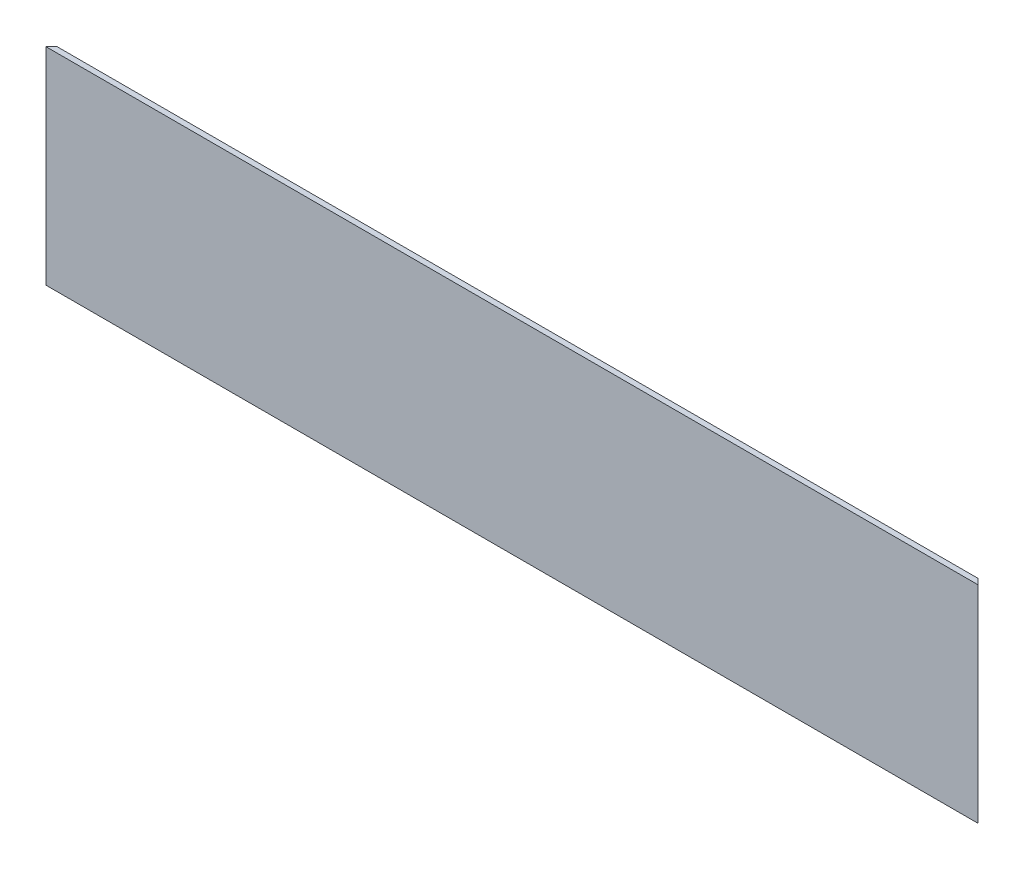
ISO-10303-21;
HEADER;
FILE_DESCRIPTION(('STEP AP214'),'2;1');
FILE_NAME('part.step','',(''),(''),'','','');
FILE_SCHEMA(('AUTOMOTIVE_DESIGN { 1 0 10303 214 1 1 1 1 }'));
ENDSEC;
DATA;
#1=APPLICATION_CONTEXT('core data for automotive mechanical design processes');
#2=APPLICATION_PROTOCOL_DEFINITION('international standard','automotive_design',2000,#1);
#3=PRODUCT_CONTEXT('',#1,'mechanical');
#4=PRODUCT('Part','Part','',(#3));
#5=PRODUCT_RELATED_PRODUCT_CATEGORY('part','',(#4));
#6=PRODUCT_DEFINITION_FORMATION('','',#4);
#7=PRODUCT_DEFINITION_CONTEXT('part definition',#1,'design');
#8=PRODUCT_DEFINITION('design','',#6,#7);
#9=PRODUCT_DEFINITION_SHAPE('','',#8);
#10=(LENGTH_UNIT() NAMED_UNIT(*) SI_UNIT(.MILLI.,.METRE.));
#11=(NAMED_UNIT(*) PLANE_ANGLE_UNIT() SI_UNIT($,.RADIAN.));
#12=(NAMED_UNIT(*) SI_UNIT($,.STERADIAN.) SOLID_ANGLE_UNIT());
#13=UNCERTAINTY_MEASURE_WITH_UNIT(LENGTH_MEASURE(1.E-05),#10,'distance_accuracy_value','');
#14=(GEOMETRIC_REPRESENTATION_CONTEXT(3) GLOBAL_UNCERTAINTY_ASSIGNED_CONTEXT((#13)) GLOBAL_UNIT_ASSIGNED_CONTEXT((#10,
#11,#12)) REPRESENTATION_CONTEXT('',''));
#15=CARTESIAN_POINT('',(0.,0.,0.));
#16=DIRECTION('',(0.,0.,1.));
#17=DIRECTION('',(1.,0.,0.));
#18=AXIS2_PLACEMENT_3D('',#15,#16,#17);
#19=CARTESIAN_POINT('',(-830.,185.075,5.));
#20=DIRECTION('',(-0.707106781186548,0.,-0.707106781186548));
#21=DIRECTION('',(-0.707106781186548,0.,0.707106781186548));
#22=AXIS2_PLACEMENT_3D('',#19,#20,#21);
#23=PLANE('',#22);
#24=DIRECTION('',(0.,1.,0.));
#25=VECTOR('',#24,1.);
#26=CARTESIAN_POINT('',(-825.,0.,0.));
#27=LINE('',#26,#25);
#28=CARTESIAN_POINT('',(-825.,0.,0.));
#29=VERTEX_POINT('',#28);
#30=CARTESIAN_POINT('',(-825.,370.15,0.));
#31=VERTEX_POINT('',#30);
#32=EDGE_CURVE('E88',#29,#31,#27,.T.);
#33=ORIENTED_EDGE('',*,*,#32,.F.);
#34=DIRECTION('',(0.707106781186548,0.,-0.707106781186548));
#35=VECTOR('',#34,1.);
#36=CARTESIAN_POINT('',(-835.,0.,10.));
#37=LINE('',#36,#35);
#38=CARTESIAN_POINT('',(-835.,0.,10.));
#39=VERTEX_POINT('',#38);
#40=EDGE_CURVE('E71',#39,#29,#37,.T.);
#41=ORIENTED_EDGE('',*,*,#40,.F.);
#42=DIRECTION('',(0.,-1.,0.));
#43=VECTOR('',#42,1.);
#44=CARTESIAN_POINT('',(-835.,370.15,10.));
#45=LINE('',#44,#43);
#46=CARTESIAN_POINT('',(-835.,370.15,10.));
#47=VERTEX_POINT('',#46);
#48=EDGE_CURVE('E19',#47,#39,#45,.T.);
#49=ORIENTED_EDGE('',*,*,#48,.F.);
#50=DIRECTION('',(-0.707106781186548,0.,0.707106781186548));
#51=VECTOR('',#50,1.);
#52=CARTESIAN_POINT('',(-825.,370.15,0.));
#53=LINE('',#52,#51);
#54=EDGE_CURVE('E10',#31,#47,#53,.T.);
#55=ORIENTED_EDGE('',*,*,#54,.F.);
#56=EDGE_LOOP('',(#33,#41,#49,#55));
#57=FACE_BOUND('',#56,.T.);
#58=ADVANCED_FACE('F16',(#57),#23,.T.);
#59=CARTESIAN_POINT('',(0.,370.15,5.029866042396));
#60=DIRECTION('',(0.,1.,0.));
#61=DIRECTION('',(1.,0.,0.));
#62=AXIS2_PLACEMENT_3D('',#59,#60,#61);
#63=PLANE('',#62);
#64=DIRECTION('',(1.,0.,0.));
#65=VECTOR('',#64,1.);
#66=CARTESIAN_POINT('',(-825.,370.15,0.));
#67=LINE('',#66,#65);
#68=CARTESIAN_POINT('',(825.,370.15,0.));
#69=VERTEX_POINT('',#68);
#70=EDGE_CURVE('E94',#31,#69,#67,.T.);
#71=ORIENTED_EDGE('',*,*,#70,.F.);
#72=ORIENTED_EDGE('',*,*,#54,.T.);
#73=DIRECTION('',(-1.,0.,0.));
#74=VECTOR('',#73,1.);
#75=CARTESIAN_POINT('',(835.,370.15,10.));
#76=LINE('',#75,#74);
#77=CARTESIAN_POINT('',(835.,370.15,10.));
#78=VERTEX_POINT('',#77);
#79=EDGE_CURVE('E109',#78,#47,#76,.T.);
#80=ORIENTED_EDGE('',*,*,#79,.F.);
#81=DIRECTION('',(0.707106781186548,0.,0.707106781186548));
#82=VECTOR('',#81,1.);
#83=CARTESIAN_POINT('',(825.,370.15,0.));
#84=LINE('',#83,#82);
#85=EDGE_CURVE('E25',#69,#78,#84,.T.);
#86=ORIENTED_EDGE('',*,*,#85,.F.);
#87=EDGE_LOOP('',(#71,#72,#80,#86));
#88=FACE_BOUND('',#87,.T.);
#89=ADVANCED_FACE('F119',(#88),#63,.T.);
#90=CARTESIAN_POINT('',(830.,185.075,5.));
#91=DIRECTION('',(0.707106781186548,0.,-0.707106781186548));
#92=DIRECTION('',(0.,-1.,0.));
#93=AXIS2_PLACEMENT_3D('',#90,#91,#92);
#94=PLANE('',#93);
#95=DIRECTION('',(0.,-1.,0.));
#96=VECTOR('',#95,1.);
#97=CARTESIAN_POINT('',(825.,370.15,0.));
#98=LINE('',#97,#96);
#99=CARTESIAN_POINT('',(825.,0.,0.));
#100=VERTEX_POINT('',#99);
#101=EDGE_CURVE('E89',#69,#100,#98,.T.);
#102=ORIENTED_EDGE('',*,*,#101,.F.);
#103=ORIENTED_EDGE('',*,*,#85,.T.);
#104=DIRECTION('',(0.,1.,0.));
#105=VECTOR('',#104,1.);
#106=CARTESIAN_POINT('',(835.,0.,10.));
#107=LINE('',#106,#105);
#108=CARTESIAN_POINT('',(835.,0.,10.));
#109=VERTEX_POINT('',#108);
#110=EDGE_CURVE('E82',#109,#78,#107,.T.);
#111=ORIENTED_EDGE('',*,*,#110,.F.);
#112=DIRECTION('',(0.707106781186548,0.,0.707106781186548));
#113=VECTOR('',#112,1.);
#114=CARTESIAN_POINT('',(825.,0.,0.));
#115=LINE('',#114,#113);
#116=EDGE_CURVE('E91',#100,#109,#115,.T.);
#117=ORIENTED_EDGE('',*,*,#116,.F.);
#118=EDGE_LOOP('',(#102,#103,#111,#117));
#119=FACE_BOUND('',#118,.T.);
#120=ADVANCED_FACE('F120',(#119),#94,.T.);
#121=CARTESIAN_POINT('',(0.,185.075,10.));
#122=DIRECTION('',(0.,0.,1.));
#123=DIRECTION('',(1.,0.,0.));
#124=AXIS2_PLACEMENT_3D('',#121,#122,#123);
#125=PLANE('',#124);
#126=DIRECTION('',(1.,0.,0.));
#127=VECTOR('',#126,1.);
#128=CARTESIAN_POINT('',(-835.,0.,10.));
#129=LINE('',#128,#127);
#130=EDGE_CURVE('E78',#39,#109,#129,.T.);
#131=ORIENTED_EDGE('',*,*,#130,.T.);
#132=ORIENTED_EDGE('',*,*,#110,.T.);
#133=ORIENTED_EDGE('',*,*,#79,.T.);
#134=ORIENTED_EDGE('',*,*,#48,.T.);
#135=EDGE_LOOP('',(#131,#132,#133,#134));
#136=FACE_BOUND('',#135,.T.);
#137=ADVANCED_FACE('F118',(#136),#125,.T.);
#138=CARTESIAN_POINT('',(0.,0.,5.029866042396));
#139=DIRECTION('',(0.,-1.,0.));
#140=DIRECTION('',(0.,0.,-1.));
#141=AXIS2_PLACEMENT_3D('',#138,#139,#140);
#142=PLANE('',#141);
#143=DIRECTION('',(-1.,0.,0.));
#144=VECTOR('',#143,1.);
#145=CARTESIAN_POINT('',(825.,0.,0.));
#146=LINE('',#145,#144);
#147=EDGE_CURVE('E75',#100,#29,#146,.T.);
#148=ORIENTED_EDGE('',*,*,#147,.F.);
#149=ORIENTED_EDGE('',*,*,#116,.T.);
#150=ORIENTED_EDGE('',*,*,#130,.F.);
#151=ORIENTED_EDGE('',*,*,#40,.T.);
#152=EDGE_LOOP('',(#148,#149,#150,#151));
#153=FACE_BOUND('',#152,.T.);
#154=ADVANCED_FACE('F73',(#153),#142,.T.);
#155=CARTESIAN_POINT('',(0.,185.075,0.));
#156=DIRECTION('',(0.,0.,-1.));
#157=DIRECTION('',(0.,-1.,0.));
#158=AXIS2_PLACEMENT_3D('',#155,#156,#157);
#159=PLANE('',#158);
#160=ORIENTED_EDGE('',*,*,#32,.T.);
#161=ORIENTED_EDGE('',*,*,#70,.T.);
#162=ORIENTED_EDGE('',*,*,#101,.T.);
#163=ORIENTED_EDGE('',*,*,#147,.T.);
#164=EDGE_LOOP('',(#160,#161,#162,#163));
#165=FACE_BOUND('',#164,.T.);
#166=ADVANCED_FACE('F86',(#165),#159,.T.);
#167=CLOSED_SHELL('',(#58,#89,#120,#137,#154,#166));
#168=MANIFOLD_SOLID_BREP('B1',#167);
#169=ADVANCED_BREP_SHAPE_REPRESENTATION('',(#18,#168),#14);
#170=SHAPE_DEFINITION_REPRESENTATION(#9,#169);
ENDSEC;
END-ISO-10303-21;
